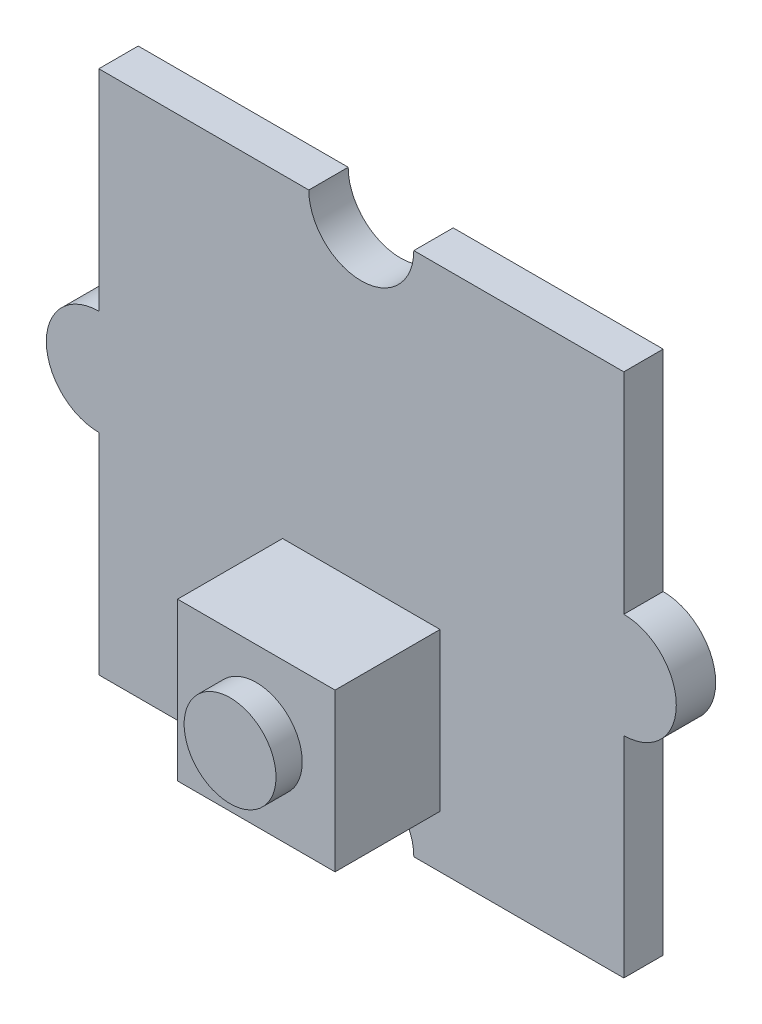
ISO-10303-21;
HEADER;
FILE_DESCRIPTION(('STEP AP214'),'2;1');
FILE_NAME('part.step','',(''),(''),'','','');
FILE_SCHEMA(('AUTOMOTIVE_DESIGN { 1 0 10303 214 1 1 1 1 }'));
ENDSEC;
DATA;
#1=APPLICATION_CONTEXT('core data for automotive mechanical design processes');
#2=APPLICATION_PROTOCOL_DEFINITION('international standard','automotive_design',2000,#1);
#3=PRODUCT_CONTEXT('',#1,'mechanical');
#4=PRODUCT('Part','Part','',(#3));
#5=PRODUCT_RELATED_PRODUCT_CATEGORY('part','',(#4));
#6=PRODUCT_DEFINITION_FORMATION('','',#4);
#7=PRODUCT_DEFINITION_CONTEXT('part definition',#1,'design');
#8=PRODUCT_DEFINITION('design','',#6,#7);
#9=PRODUCT_DEFINITION_SHAPE('','',#8);
#10=(LENGTH_UNIT() NAMED_UNIT(*) SI_UNIT(.MILLI.,.METRE.));
#11=(NAMED_UNIT(*) PLANE_ANGLE_UNIT() SI_UNIT($,.RADIAN.));
#12=(NAMED_UNIT(*) SI_UNIT($,.STERADIAN.) SOLID_ANGLE_UNIT());
#13=UNCERTAINTY_MEASURE_WITH_UNIT(LENGTH_MEASURE(1.E-05),#10,'distance_accuracy_value','');
#14=(GEOMETRIC_REPRESENTATION_CONTEXT(3) GLOBAL_UNCERTAINTY_ASSIGNED_CONTEXT((#13)) GLOBAL_UNIT_ASSIGNED_CONTEXT((#10,
#11,#12)) REPRESENTATION_CONTEXT('',''));
#15=CARTESIAN_POINT('',(0.,0.,0.));
#16=DIRECTION('',(0.,0.,1.));
#17=DIRECTION('',(1.,0.,0.));
#18=AXIS2_PLACEMENT_3D('',#15,#16,#17);
#19=CARTESIAN_POINT('',(0.,0.,1.5));
#20=DIRECTION('',(0.,1.,0.));
#21=DIRECTION('',(0.,0.,1.));
#22=AXIS2_PLACEMENT_3D('',#19,#20,#21);
#23=PLANE('',#22);
#24=DIRECTION('',(1.,0.,0.));
#25=VECTOR('',#24,1.);
#26=CARTESIAN_POINT('',(0.,0.,0.));
#27=LINE('',#26,#25);
#28=CARTESIAN_POINT('',(0.,0.,0.));
#29=VERTEX_POINT('',#28);
#30=CARTESIAN_POINT('',(8.,0.,0.));
#31=VERTEX_POINT('',#30);
#32=EDGE_CURVE('E199',#29,#31,#27,.T.);
#33=ORIENTED_EDGE('',*,*,#32,.T.);
#34=DIRECTION('',(0.,0.,1.));
#35=VECTOR('',#34,1.);
#36=CARTESIAN_POINT('',(8.,0.,0.));
#37=LINE('',#36,#35);
#38=CARTESIAN_POINT('',(8.,0.,1.5));
#39=VERTEX_POINT('',#38);
#40=EDGE_CURVE('E48',#31,#39,#37,.T.);
#41=ORIENTED_EDGE('',*,*,#40,.T.);
#42=DIRECTION('',(1.,0.,0.));
#43=VECTOR('',#42,1.);
#44=CARTESIAN_POINT('',(0.,0.,1.5));
#45=LINE('',#44,#43);
#46=CARTESIAN_POINT('',(0.,0.,1.5));
#47=VERTEX_POINT('',#46);
#48=EDGE_CURVE('E170',#47,#39,#45,.T.);
#49=ORIENTED_EDGE('',*,*,#48,.F.);
#50=DIRECTION('',(0.,0.,-1.));
#51=VECTOR('',#50,1.);
#52=CARTESIAN_POINT('',(0.,0.,1.5));
#53=LINE('',#52,#51);
#54=EDGE_CURVE('E41',#47,#29,#53,.T.);
#55=ORIENTED_EDGE('',*,*,#54,.T.);
#56=EDGE_LOOP('',(#33,#41,#49,#55));
#57=FACE_BOUND('',#56,.T.);
#58=ADVANCED_FACE('F33',(#57),#23,.F.);
#59=CARTESIAN_POINT('',(0.,20.,1.5));
#60=DIRECTION('',(0.,-1.,0.));
#61=DIRECTION('',(0.,0.,-1.));
#62=AXIS2_PLACEMENT_3D('',#59,#60,#61);
#63=PLANE('',#62);
#64=DIRECTION('',(-1.,0.,0.));
#65=VECTOR('',#64,1.);
#66=CARTESIAN_POINT('',(0.,20.,0.));
#67=LINE('',#66,#65);
#68=CARTESIAN_POINT('',(20.,20.,0.));
#69=VERTEX_POINT('',#68);
#70=CARTESIAN_POINT('',(12.,20.,0.));
#71=VERTEX_POINT('',#70);
#72=EDGE_CURVE('E209',#69,#71,#67,.T.);
#73=ORIENTED_EDGE('',*,*,#72,.T.);
#74=DIRECTION('',(0.,0.,1.));
#75=VECTOR('',#74,1.);
#76=CARTESIAN_POINT('',(12.,20.,0.));
#77=LINE('',#76,#75);
#78=CARTESIAN_POINT('',(12.,20.,1.5));
#79=VERTEX_POINT('',#78);
#80=EDGE_CURVE('E56',#71,#79,#77,.T.);
#81=ORIENTED_EDGE('',*,*,#80,.T.);
#82=DIRECTION('',(-1.,0.,0.));
#83=VECTOR('',#82,1.);
#84=CARTESIAN_POINT('',(0.,20.,1.5));
#85=LINE('',#84,#83);
#86=CARTESIAN_POINT('',(20.,20.,1.5));
#87=VERTEX_POINT('',#86);
#88=EDGE_CURVE('E186',#87,#79,#85,.T.);
#89=ORIENTED_EDGE('',*,*,#88,.F.);
#90=DIRECTION('',(0.,0.,-1.));
#91=VECTOR('',#90,1.);
#92=CARTESIAN_POINT('',(20.,20.,1.5));
#93=LINE('',#92,#91);
#94=EDGE_CURVE('E223',#87,#69,#93,.T.);
#95=ORIENTED_EDGE('',*,*,#94,.T.);
#96=EDGE_LOOP('',(#73,#81,#89,#95));
#97=FACE_BOUND('',#96,.T.);
#98=ADVANCED_FACE('F315',(#97),#63,.F.);
#99=CARTESIAN_POINT('',(0.,10.,1.5));
#100=DIRECTION('',(0.,0.,1.));
#101=DIRECTION('',(1.,0.,0.));
#102=AXIS2_PLACEMENT_3D('',#99,#100,#101);
#103=PLANE('',#102);
#104=CARTESIAN_POINT('',(10.,0.,1.5));
#105=DIRECTION('',(0.,0.,1.));
#106=DIRECTION('',(1.,0.,0.));
#107=AXIS2_PLACEMENT_3D('',#104,#105,#106);
#108=CIRCLE('',#107,2.);
#109=CARTESIAN_POINT('',(12.,0.,1.5));
#110=VERTEX_POINT('',#109);
#111=CARTESIAN_POINT('',(10.,2.,1.5));
#112=VERTEX_POINT('',#111);
#113=EDGE_CURVE('E149',#110,#112,#108,.T.);
#114=ORIENTED_EDGE('',*,*,#113,.F.);
#115=CARTESIAN_POINT('',(20.,0.,1.5));
#116=VERTEX_POINT('',#115);
#117=EDGE_CURVE('E159',#110,#116,#45,.T.);
#118=ORIENTED_EDGE('',*,*,#117,.T.);
#119=DIRECTION('',(0.,1.,0.));
#120=VECTOR('',#119,1.);
#121=CARTESIAN_POINT('',(20.,0.,1.5));
#122=LINE('',#121,#120);
#123=CARTESIAN_POINT('',(20.,8.,1.5));
#124=VERTEX_POINT('',#123);
#125=EDGE_CURVE('E174',#116,#124,#122,.T.);
#126=ORIENTED_EDGE('',*,*,#125,.T.);
#127=CARTESIAN_POINT('',(20.,10.,1.5));
#128=DIRECTION('',(0.,0.,1.));
#129=DIRECTION('',(1.,0.,0.));
#130=AXIS2_PLACEMENT_3D('',#127,#128,#129);
#131=CIRCLE('',#130,2.);
#132=CARTESIAN_POINT('',(20.,12.,1.5));
#133=VERTEX_POINT('',#132);
#134=EDGE_CURVE('E181',#124,#133,#131,.T.);
#135=ORIENTED_EDGE('',*,*,#134,.T.);
#136=DIRECTION('',(0.,1.,0.));
#137=VECTOR('',#136,1.);
#138=CARTESIAN_POINT('',(20.,12.,1.5));
#139=LINE('',#138,#137);
#140=EDGE_CURVE('E183',#133,#87,#139,.T.);
#141=ORIENTED_EDGE('',*,*,#140,.T.);
#142=ORIENTED_EDGE('',*,*,#88,.T.);
#143=CARTESIAN_POINT('',(10.,20.,1.5));
#144=DIRECTION('',(0.,0.,1.));
#145=DIRECTION('',(1.,0.,0.));
#146=AXIS2_PLACEMENT_3D('',#143,#144,#145);
#147=CIRCLE('',#146,2.);
#148=CARTESIAN_POINT('',(8.,20.,1.5));
#149=VERTEX_POINT('',#148);
#150=EDGE_CURVE('E247',#149,#79,#147,.T.);
#151=ORIENTED_EDGE('',*,*,#150,.F.);
#152=CARTESIAN_POINT('',(0.,20.,1.5));
#153=VERTEX_POINT('',#152);
#154=EDGE_CURVE('E185',#149,#153,#85,.T.);
#155=ORIENTED_EDGE('',*,*,#154,.T.);
#156=DIRECTION('',(0.,-1.,0.));
#157=VECTOR('',#156,1.);
#158=CARTESIAN_POINT('',(0.,12.,1.5));
#159=LINE('',#158,#157);
#160=CARTESIAN_POINT('',(0.,12.,1.5));
#161=VERTEX_POINT('',#160);
#162=EDGE_CURVE('E189',#153,#161,#159,.T.);
#163=ORIENTED_EDGE('',*,*,#162,.T.);
#164=CARTESIAN_POINT('',(0.,10.,1.5));
#165=DIRECTION('',(0.,0.,1.));
#166=DIRECTION('',(1.,0.,0.));
#167=AXIS2_PLACEMENT_3D('',#164,#165,#166);
#168=CIRCLE('',#167,2.);
#169=CARTESIAN_POINT('',(0.,8.,1.5));
#170=VERTEX_POINT('',#169);
#171=EDGE_CURVE('E191',#161,#170,#168,.T.);
#172=ORIENTED_EDGE('',*,*,#171,.T.);
#173=DIRECTION('',(0.,-1.,0.));
#174=VECTOR('',#173,1.);
#175=CARTESIAN_POINT('',(0.,0.,1.5));
#176=LINE('',#175,#174);
#177=EDGE_CURVE('E171',#170,#47,#176,.T.);
#178=ORIENTED_EDGE('',*,*,#177,.T.);
#179=ORIENTED_EDGE('',*,*,#48,.T.);
#180=EDGE_CURVE('E164',#112,#39,#108,.T.);
#181=ORIENTED_EDGE('',*,*,#180,.F.);
#182=DIRECTION('',(1.,0.,0.));
#183=VECTOR('',#182,1.);
#184=CARTESIAN_POINT('',(7.,2.,1.5));
#185=LINE('',#184,#183);
#186=CARTESIAN_POINT('',(7.,2.,1.5));
#187=VERTEX_POINT('',#186);
#188=EDGE_CURVE('E273',#187,#112,#185,.T.);
#189=ORIENTED_EDGE('',*,*,#188,.F.);
#190=DIRECTION('',(0.,-1.,0.));
#191=VECTOR('',#190,1.);
#192=CARTESIAN_POINT('',(7.,8.,1.5));
#193=LINE('',#192,#191);
#194=CARTESIAN_POINT('',(7.,8.,1.5));
#195=VERTEX_POINT('',#194);
#196=EDGE_CURVE('E257',#195,#187,#193,.T.);
#197=ORIENTED_EDGE('',*,*,#196,.F.);
#198=DIRECTION('',(-1.,0.,0.));
#199=VECTOR('',#198,1.);
#200=CARTESIAN_POINT('',(7.,8.,1.5));
#201=LINE('',#200,#199);
#202=CARTESIAN_POINT('',(13.,8.,1.5));
#203=VERTEX_POINT('',#202);
#204=EDGE_CURVE('E264',#203,#195,#201,.T.);
#205=ORIENTED_EDGE('',*,*,#204,.F.);
#206=DIRECTION('',(0.,1.,0.));
#207=VECTOR('',#206,1.);
#208=CARTESIAN_POINT('',(13.,8.,1.5));
#209=LINE('',#208,#207);
#210=CARTESIAN_POINT('',(13.,2.,1.5));
#211=VERTEX_POINT('',#210);
#212=EDGE_CURVE('E275',#211,#203,#209,.T.);
#213=ORIENTED_EDGE('',*,*,#212,.F.);
#214=EDGE_CURVE('E162',#112,#211,#185,.T.);
#215=ORIENTED_EDGE('',*,*,#214,.F.);
#216=EDGE_LOOP('',(#114,#118,#126,#135,#141,#142,#151,#155,#163,#172,#178,#179,#181,#189,#197,
#205,#213,#215));
#217=FACE_BOUND('',#216,.T.);
#218=ADVANCED_FACE('F158',(#217),#103,.T.);
#219=CARTESIAN_POINT('',(0.,0.,1.5));
#220=DIRECTION('',(1.,0.,0.));
#221=DIRECTION('',(0.,0.,-1.));
#222=AXIS2_PLACEMENT_3D('',#219,#220,#221);
#223=PLANE('',#222);
#224=DIRECTION('',(0.,-1.,0.));
#225=VECTOR('',#224,1.);
#226=CARTESIAN_POINT('',(0.,0.,0.));
#227=LINE('',#226,#225);
#228=CARTESIAN_POINT('',(0.,8.,0.));
#229=VERTEX_POINT('',#228);
#230=EDGE_CURVE('E194',#229,#29,#227,.T.);
#231=ORIENTED_EDGE('',*,*,#230,.T.);
#232=ORIENTED_EDGE('',*,*,#54,.F.);
#233=ORIENTED_EDGE('',*,*,#177,.F.);
#234=DIRECTION('',(0.,0.,-1.));
#235=VECTOR('',#234,1.);
#236=CARTESIAN_POINT('',(0.,8.,1.5));
#237=LINE('',#236,#235);
#238=EDGE_CURVE('E193',#170,#229,#237,.T.);
#239=ORIENTED_EDGE('',*,*,#238,.T.);
#240=EDGE_LOOP('',(#231,#232,#233,#239));
#241=FACE_BOUND('',#240,.T.);
#242=ADVANCED_FACE('F35',(#241),#223,.F.);
#243=ORIENTED_EDGE('',*,*,#117,.F.);
#244=DIRECTION('',(0.,0.,1.));
#245=VECTOR('',#244,1.);
#246=CARTESIAN_POINT('',(12.,0.,0.));
#247=LINE('',#246,#245);
#248=CARTESIAN_POINT('',(12.,0.,0.));
#249=VERTEX_POINT('',#248);
#250=EDGE_CURVE('E146',#110,#249,#247,.F.);
#251=ORIENTED_EDGE('',*,*,#250,.T.);
#252=CARTESIAN_POINT('',(20.,0.,0.));
#253=VERTEX_POINT('',#252);
#254=EDGE_CURVE('E197',#249,#253,#27,.T.);
#255=ORIENTED_EDGE('',*,*,#254,.T.);
#256=DIRECTION('',(0.,0.,-1.));
#257=VECTOR('',#256,1.);
#258=CARTESIAN_POINT('',(20.,0.,1.5));
#259=LINE('',#258,#257);
#260=EDGE_CURVE('E168',#116,#253,#259,.T.);
#261=ORIENTED_EDGE('',*,*,#260,.F.);
#262=EDGE_LOOP('',(#243,#251,#255,#261));
#263=FACE_BOUND('',#262,.T.);
#264=ADVANCED_FACE('F166',(#263),#23,.F.);
#265=CARTESIAN_POINT('',(20.,0.,1.5));
#266=DIRECTION('',(-1.,0.,0.));
#267=DIRECTION('',(0.,0.,1.));
#268=AXIS2_PLACEMENT_3D('',#265,#266,#267);
#269=PLANE('',#268);
#270=DIRECTION('',(0.,1.,0.));
#271=VECTOR('',#270,1.);
#272=CARTESIAN_POINT('',(20.,0.,0.));
#273=LINE('',#272,#271);
#274=CARTESIAN_POINT('',(20.,8.,0.));
#275=VERTEX_POINT('',#274);
#276=EDGE_CURVE('E202',#253,#275,#273,.T.);
#277=ORIENTED_EDGE('',*,*,#276,.T.);
#278=DIRECTION('',(0.,0.,-1.));
#279=VECTOR('',#278,1.);
#280=CARTESIAN_POINT('',(20.,8.,1.5));
#281=LINE('',#280,#279);
#282=EDGE_CURVE('E229',#124,#275,#281,.T.);
#283=ORIENTED_EDGE('',*,*,#282,.F.);
#284=ORIENTED_EDGE('',*,*,#125,.F.);
#285=ORIENTED_EDGE('',*,*,#260,.T.);
#286=EDGE_LOOP('',(#277,#283,#284,#285));
#287=FACE_BOUND('',#286,.T.);
#288=ADVANCED_FACE('F326',(#287),#269,.F.);
#289=CARTESIAN_POINT('',(20.,10.,1.5));
#290=DIRECTION('',(0.,0.,-1.));
#291=DIRECTION('',(-1.,0.,0.));
#292=AXIS2_PLACEMENT_3D('',#289,#290,#291);
#293=CYLINDRICAL_SURFACE('',#292,2.);
#294=CARTESIAN_POINT('',(20.,10.,0.));
#295=DIRECTION('',(0.,0.,1.));
#296=DIRECTION('',(1.,0.,0.));
#297=AXIS2_PLACEMENT_3D('',#294,#295,#296);
#298=CIRCLE('',#297,2.);
#299=CARTESIAN_POINT('',(20.,12.,0.));
#300=VERTEX_POINT('',#299);
#301=EDGE_CURVE('E204',#275,#300,#298,.T.);
#302=ORIENTED_EDGE('',*,*,#301,.T.);
#303=DIRECTION('',(0.,0.,-1.));
#304=VECTOR('',#303,1.);
#305=CARTESIAN_POINT('',(20.,12.,1.5));
#306=LINE('',#305,#304);
#307=EDGE_CURVE('E226',#133,#300,#306,.T.);
#308=ORIENTED_EDGE('',*,*,#307,.F.);
#309=ORIENTED_EDGE('',*,*,#134,.F.);
#310=ORIENTED_EDGE('',*,*,#282,.T.);
#311=EDGE_LOOP('',(#302,#308,#309,#310));
#312=FACE_BOUND('',#311,.T.);
#313=ADVANCED_FACE('F323',(#312),#293,.T.);
#314=CARTESIAN_POINT('',(20.,12.,1.5));
#315=DIRECTION('',(-1.,0.,0.));
#316=DIRECTION('',(0.,0.,1.));
#317=AXIS2_PLACEMENT_3D('',#314,#315,#316);
#318=PLANE('',#317);
#319=DIRECTION('',(0.,1.,0.));
#320=VECTOR('',#319,1.);
#321=CARTESIAN_POINT('',(20.,12.,0.));
#322=LINE('',#321,#320);
#323=EDGE_CURVE('E206',#300,#69,#322,.T.);
#324=ORIENTED_EDGE('',*,*,#323,.T.);
#325=ORIENTED_EDGE('',*,*,#94,.F.);
#326=ORIENTED_EDGE('',*,*,#140,.F.);
#327=ORIENTED_EDGE('',*,*,#307,.T.);
#328=EDGE_LOOP('',(#324,#325,#326,#327));
#329=FACE_BOUND('',#328,.T.);
#330=ADVANCED_FACE('F319',(#329),#318,.F.);
#331=ORIENTED_EDGE('',*,*,#154,.F.);
#332=DIRECTION('',(0.,0.,1.));
#333=VECTOR('',#332,1.);
#334=CARTESIAN_POINT('',(8.,20.,0.));
#335=LINE('',#334,#333);
#336=CARTESIAN_POINT('',(8.,20.,0.));
#337=VERTEX_POINT('',#336);
#338=EDGE_CURVE('E249',#149,#337,#335,.F.);
#339=ORIENTED_EDGE('',*,*,#338,.T.);
#340=CARTESIAN_POINT('',(0.,20.,0.));
#341=VERTEX_POINT('',#340);
#342=EDGE_CURVE('E208',#337,#341,#67,.T.);
#343=ORIENTED_EDGE('',*,*,#342,.T.);
#344=DIRECTION('',(0.,0.,-1.));
#345=VECTOR('',#344,1.);
#346=CARTESIAN_POINT('',(0.,20.,1.5));
#347=LINE('',#346,#345);
#348=EDGE_CURVE('E220',#153,#341,#347,.T.);
#349=ORIENTED_EDGE('',*,*,#348,.F.);
#350=EDGE_LOOP('',(#331,#339,#343,#349));
#351=FACE_BOUND('',#350,.T.);
#352=ADVANCED_FACE('F308',(#351),#63,.F.);
#353=CARTESIAN_POINT('',(0.,12.,1.5));
#354=DIRECTION('',(1.,0.,0.));
#355=DIRECTION('',(0.,0.,-1.));
#356=AXIS2_PLACEMENT_3D('',#353,#354,#355);
#357=PLANE('',#356);
#358=DIRECTION('',(0.,-1.,0.));
#359=VECTOR('',#358,1.);
#360=CARTESIAN_POINT('',(0.,12.,0.));
#361=LINE('',#360,#359);
#362=CARTESIAN_POINT('',(0.,12.,0.));
#363=VERTEX_POINT('',#362);
#364=EDGE_CURVE('E212',#341,#363,#361,.T.);
#365=ORIENTED_EDGE('',*,*,#364,.T.);
#366=DIRECTION('',(0.,0.,-1.));
#367=VECTOR('',#366,1.);
#368=CARTESIAN_POINT('',(0.,12.,1.5));
#369=LINE('',#368,#367);
#370=EDGE_CURVE('E217',#161,#363,#369,.T.);
#371=ORIENTED_EDGE('',*,*,#370,.F.);
#372=ORIENTED_EDGE('',*,*,#162,.F.);
#373=ORIENTED_EDGE('',*,*,#348,.T.);
#374=EDGE_LOOP('',(#365,#371,#372,#373));
#375=FACE_BOUND('',#374,.T.);
#376=ADVANCED_FACE('F302',(#375),#357,.F.);
#377=CARTESIAN_POINT('',(0.,10.,1.5));
#378=DIRECTION('',(0.,0.,-1.));
#379=DIRECTION('',(-1.,0.,0.));
#380=AXIS2_PLACEMENT_3D('',#377,#378,#379);
#381=CYLINDRICAL_SURFACE('',#380,2.);
#382=CARTESIAN_POINT('',(0.,10.,0.));
#383=DIRECTION('',(0.,0.,1.));
#384=DIRECTION('',(1.,0.,0.));
#385=AXIS2_PLACEMENT_3D('',#382,#383,#384);
#386=CIRCLE('',#385,2.);
#387=EDGE_CURVE('E176',#363,#229,#386,.T.);
#388=ORIENTED_EDGE('',*,*,#387,.T.);
#389=ORIENTED_EDGE('',*,*,#238,.F.);
#390=ORIENTED_EDGE('',*,*,#171,.F.);
#391=ORIENTED_EDGE('',*,*,#370,.T.);
#392=EDGE_LOOP('',(#388,#389,#390,#391));
#393=FACE_BOUND('',#392,.T.);
#394=ADVANCED_FACE('F300',(#393),#381,.T.);
#395=CARTESIAN_POINT('',(0.,10.,0.));
#396=DIRECTION('',(0.,0.,1.));
#397=DIRECTION('',(1.,0.,0.));
#398=AXIS2_PLACEMENT_3D('',#395,#396,#397);
#399=PLANE('',#398);
#400=ORIENTED_EDGE('',*,*,#254,.F.);
#401=CARTESIAN_POINT('',(10.,0.,0.));
#402=DIRECTION('',(0.,0.,1.));
#403=DIRECTION('',(1.,0.,0.));
#404=AXIS2_PLACEMENT_3D('',#401,#402,#403);
#405=CIRCLE('',#404,2.);
#406=EDGE_CURVE('E151',#249,#31,#405,.T.);
#407=ORIENTED_EDGE('',*,*,#406,.T.);
#408=ORIENTED_EDGE('',*,*,#32,.F.);
#409=ORIENTED_EDGE('',*,*,#230,.F.);
#410=ORIENTED_EDGE('',*,*,#387,.F.);
#411=ORIENTED_EDGE('',*,*,#364,.F.);
#412=ORIENTED_EDGE('',*,*,#342,.F.);
#413=CARTESIAN_POINT('',(10.,20.,0.));
#414=DIRECTION('',(0.,0.,1.));
#415=DIRECTION('',(1.,0.,0.));
#416=AXIS2_PLACEMENT_3D('',#413,#414,#415);
#417=CIRCLE('',#416,2.);
#418=EDGE_CURVE('E11',#337,#71,#417,.T.);
#419=ORIENTED_EDGE('',*,*,#418,.T.);
#420=ORIENTED_EDGE('',*,*,#72,.F.);
#421=ORIENTED_EDGE('',*,*,#323,.F.);
#422=ORIENTED_EDGE('',*,*,#301,.F.);
#423=ORIENTED_EDGE('',*,*,#276,.F.);
#424=EDGE_LOOP('',(#400,#407,#408,#409,#410,#411,#412,#419,#420,#421,#422,#423));
#425=FACE_BOUND('',#424,.T.);
#426=ADVANCED_FACE('F241',(#425),#399,.F.);
#427=CARTESIAN_POINT('',(7.,8.,5.5));
#428=DIRECTION('',(1.,0.,0.));
#429=DIRECTION('',(0.,0.,-1.));
#430=AXIS2_PLACEMENT_3D('',#427,#428,#429);
#431=PLANE('',#430);
#432=ORIENTED_EDGE('',*,*,#196,.T.);
#433=DIRECTION('',(0.,0.,-1.));
#434=VECTOR('',#433,1.);
#435=CARTESIAN_POINT('',(7.,2.,5.5));
#436=LINE('',#435,#434);
#437=CARTESIAN_POINT('',(7.,2.,5.5));
#438=VERTEX_POINT('',#437);
#439=EDGE_CURVE('E198',#438,#187,#436,.T.);
#440=ORIENTED_EDGE('',*,*,#439,.F.);
#441=DIRECTION('',(0.,-1.,0.));
#442=VECTOR('',#441,1.);
#443=CARTESIAN_POINT('',(7.,8.,5.5));
#444=LINE('',#443,#442);
#445=CARTESIAN_POINT('',(7.,8.,5.5));
#446=VERTEX_POINT('',#445);
#447=EDGE_CURVE('E260',#446,#438,#444,.T.);
#448=ORIENTED_EDGE('',*,*,#447,.F.);
#449=DIRECTION('',(0.,0.,-1.));
#450=VECTOR('',#449,1.);
#451=CARTESIAN_POINT('',(7.,8.,5.5));
#452=LINE('',#451,#450);
#453=EDGE_CURVE('E270',#446,#195,#452,.T.);
#454=ORIENTED_EDGE('',*,*,#453,.T.);
#455=EDGE_LOOP('',(#432,#440,#448,#454));
#456=FACE_BOUND('',#455,.T.);
#457=ADVANCED_FACE('F293',(#456),#431,.F.);
#458=CARTESIAN_POINT('',(7.,2.,5.5));
#459=DIRECTION('',(0.,1.,0.));
#460=DIRECTION('',(0.,0.,1.));
#461=AXIS2_PLACEMENT_3D('',#458,#459,#460);
#462=PLANE('',#461);
#463=ORIENTED_EDGE('',*,*,#188,.T.);
#464=ORIENTED_EDGE('',*,*,#214,.T.);
#465=DIRECTION('',(0.,0.,-1.));
#466=VECTOR('',#465,1.);
#467=CARTESIAN_POINT('',(13.,2.,5.5));
#468=LINE('',#467,#466);
#469=CARTESIAN_POINT('',(13.,2.,5.5));
#470=VERTEX_POINT('',#469);
#471=EDGE_CURVE('E283',#470,#211,#468,.T.);
#472=ORIENTED_EDGE('',*,*,#471,.F.);
#473=DIRECTION('',(1.,0.,0.));
#474=VECTOR('',#473,1.);
#475=CARTESIAN_POINT('',(7.,2.,5.5));
#476=LINE('',#475,#474);
#477=EDGE_CURVE('E263',#438,#470,#476,.T.);
#478=ORIENTED_EDGE('',*,*,#477,.F.);
#479=ORIENTED_EDGE('',*,*,#439,.T.);
#480=EDGE_LOOP('',(#463,#464,#472,#478,#479));
#481=FACE_BOUND('',#480,.T.);
#482=ADVANCED_FACE('F287',(#481),#462,.F.);
#483=CARTESIAN_POINT('',(13.,8.,5.5));
#484=DIRECTION('',(-1.,0.,0.));
#485=DIRECTION('',(0.,-1.,0.));
#486=AXIS2_PLACEMENT_3D('',#483,#484,#485);
#487=PLANE('',#486);
#488=ORIENTED_EDGE('',*,*,#212,.T.);
#489=DIRECTION('',(0.,0.,-1.));
#490=VECTOR('',#489,1.);
#491=CARTESIAN_POINT('',(13.,8.,5.5));
#492=LINE('',#491,#490);
#493=CARTESIAN_POINT('',(13.,8.,5.5));
#494=VERTEX_POINT('',#493);
#495=EDGE_CURVE('E281',#494,#203,#492,.T.);
#496=ORIENTED_EDGE('',*,*,#495,.F.);
#497=DIRECTION('',(0.,1.,0.));
#498=VECTOR('',#497,1.);
#499=CARTESIAN_POINT('',(13.,8.,5.5));
#500=LINE('',#499,#498);
#501=EDGE_CURVE('E266',#470,#494,#500,.T.);
#502=ORIENTED_EDGE('',*,*,#501,.F.);
#503=ORIENTED_EDGE('',*,*,#471,.T.);
#504=EDGE_LOOP('',(#488,#496,#502,#503));
#505=FACE_BOUND('',#504,.T.);
#506=ADVANCED_FACE('F403',(#505),#487,.F.);
#507=CARTESIAN_POINT('',(7.,8.,5.5));
#508=DIRECTION('',(0.,-1.,0.));
#509=DIRECTION('',(1.,0.,0.));
#510=AXIS2_PLACEMENT_3D('',#507,#508,#509);
#511=PLANE('',#510);
#512=ORIENTED_EDGE('',*,*,#204,.T.);
#513=ORIENTED_EDGE('',*,*,#453,.F.);
#514=DIRECTION('',(-1.,0.,0.));
#515=VECTOR('',#514,1.);
#516=CARTESIAN_POINT('',(7.,8.,5.5));
#517=LINE('',#516,#515);
#518=EDGE_CURVE('E268',#494,#446,#517,.T.);
#519=ORIENTED_EDGE('',*,*,#518,.F.);
#520=ORIENTED_EDGE('',*,*,#495,.T.);
#521=EDGE_LOOP('',(#512,#513,#519,#520));
#522=FACE_BOUND('',#521,.T.);
#523=ADVANCED_FACE('F439',(#522),#511,.F.);
#524=CARTESIAN_POINT('',(0.,0.,5.5));
#525=DIRECTION('',(0.,0.,1.));
#526=DIRECTION('',(1.,0.,0.));
#527=AXIS2_PLACEMENT_3D('',#524,#525,#526);
#528=PLANE('',#527);
#529=CARTESIAN_POINT('',(10.,5.,5.5));
#530=DIRECTION('',(0.,0.,1.));
#531=DIRECTION('',(1.,0.,0.));
#532=AXIS2_PLACEMENT_3D('',#529,#530,#531);
#533=CIRCLE('',#532,1.75);
#534=CARTESIAN_POINT('',(11.75,5.,5.5));
#535=VERTEX_POINT('',#534);
#536=EDGE_CURVE('E253',#535,#535,#533,.T.);
#537=ORIENTED_EDGE('',*,*,#536,.F.);
#538=EDGE_LOOP('',(#537));
#539=FACE_BOUND('',#538,.T.);
#540=ORIENTED_EDGE('',*,*,#447,.T.);
#541=ORIENTED_EDGE('',*,*,#477,.T.);
#542=ORIENTED_EDGE('',*,*,#501,.T.);
#543=ORIENTED_EDGE('',*,*,#518,.T.);
#544=EDGE_LOOP('',(#540,#541,#542,#543));
#545=FACE_BOUND('',#544,.T.);
#546=ADVANCED_FACE('F435',(#539,#545),#528,.T.);
#547=CARTESIAN_POINT('',(10.,5.,6.5));
#548=DIRECTION('',(0.,0.,-1.));
#549=DIRECTION('',(-1.,0.,0.));
#550=AXIS2_PLACEMENT_3D('',#547,#548,#549);
#551=CYLINDRICAL_SURFACE('',#550,1.75);
#552=CARTESIAN_POINT('',(10.,5.,6.5));
#553=DIRECTION('',(0.,0.,1.));
#554=DIRECTION('',(1.,0.,0.));
#555=AXIS2_PLACEMENT_3D('',#552,#553,#554);
#556=CIRCLE('',#555,1.75);
#557=CARTESIAN_POINT('',(11.75,5.,6.5));
#558=VERTEX_POINT('',#557);
#559=EDGE_CURVE('E254',#558,#558,#556,.T.);
#560=ORIENTED_EDGE('',*,*,#559,.F.);
#561=EDGE_LOOP('',(#560));
#562=FACE_BOUND('',#561,.T.);
#563=ORIENTED_EDGE('',*,*,#536,.T.);
#564=EDGE_LOOP('',(#563));
#565=FACE_BOUND('',#564,.T.);
#566=ADVANCED_FACE('F431',(#562,#565),#551,.T.);
#567=CARTESIAN_POINT('',(10.,5.,6.5));
#568=DIRECTION('',(0.,0.,1.));
#569=DIRECTION('',(1.,0.,0.));
#570=AXIS2_PLACEMENT_3D('',#567,#568,#569);
#571=PLANE('',#570);
#572=ORIENTED_EDGE('',*,*,#559,.T.);
#573=EDGE_LOOP('',(#572));
#574=FACE_BOUND('',#573,.T.);
#575=ADVANCED_FACE('F415',(#574),#571,.T.);
#576=CARTESIAN_POINT('',(10.,20.,0.));
#577=DIRECTION('',(0.,0.,1.));
#578=DIRECTION('',(1.,0.,0.));
#579=AXIS2_PLACEMENT_3D('',#576,#577,#578);
#580=CYLINDRICAL_SURFACE('',#579,2.);
#581=ORIENTED_EDGE('',*,*,#418,.F.);
#582=ORIENTED_EDGE('',*,*,#338,.F.);
#583=ORIENTED_EDGE('',*,*,#150,.T.);
#584=ORIENTED_EDGE('',*,*,#80,.F.);
#585=EDGE_LOOP('',(#581,#582,#583,#584));
#586=FACE_BOUND('',#585,.T.);
#587=ADVANCED_FACE('F310',(#586),#580,.F.);
#588=CARTESIAN_POINT('',(10.,0.,0.));
#589=DIRECTION('',(0.,0.,1.));
#590=DIRECTION('',(1.,0.,0.));
#591=AXIS2_PLACEMENT_3D('',#588,#589,#590);
#592=CYLINDRICAL_SURFACE('',#591,2.);
#593=ORIENTED_EDGE('',*,*,#406,.F.);
#594=ORIENTED_EDGE('',*,*,#250,.F.);
#595=ORIENTED_EDGE('',*,*,#113,.T.);
#596=ORIENTED_EDGE('',*,*,#180,.T.);
#597=ORIENTED_EDGE('',*,*,#40,.F.);
#598=EDGE_LOOP('',(#593,#594,#595,#596,#597));
#599=FACE_BOUND('',#598,.T.);
#600=ADVANCED_FACE('F148',(#599),#592,.F.);
#601=CLOSED_SHELL('',(#58,#98,#218,#242,#264,#288,#313,#330,#352,#376,#394,#426,#457,#482,#506,
#523,#546,#566,#575,#587,#600));
#602=MANIFOLD_SOLID_BREP('B2',#601);
#603=ADVANCED_BREP_SHAPE_REPRESENTATION('',(#18,#602),#14);
#604=SHAPE_DEFINITION_REPRESENTATION(#9,#603);
ENDSEC;
END-ISO-10303-21;
